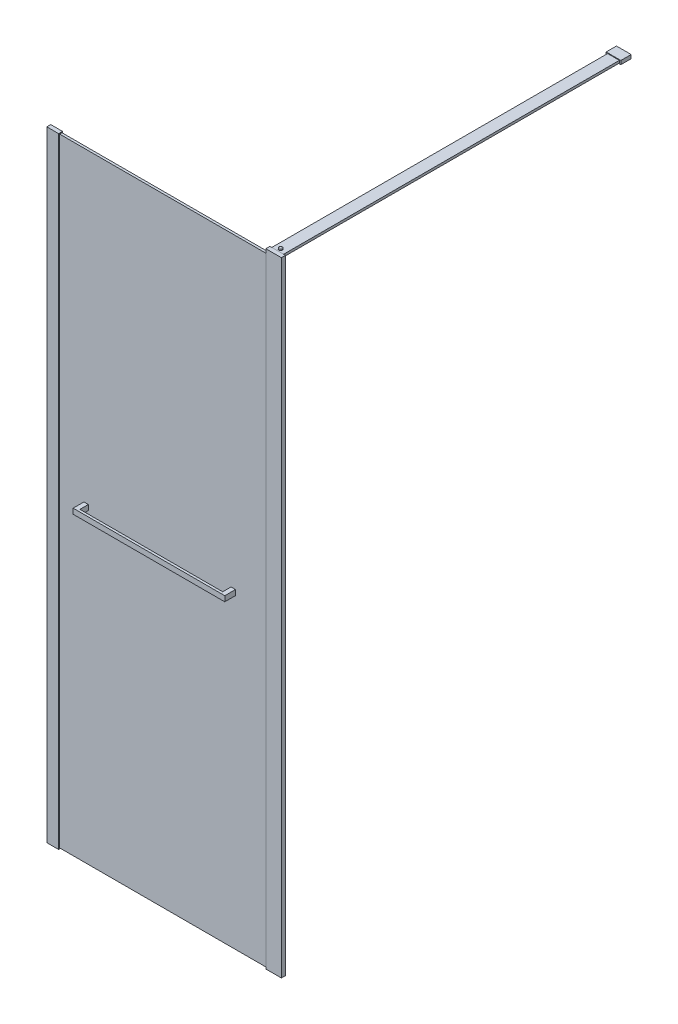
ISO-10303-21;
HEADER;
FILE_DESCRIPTION(('STEP AP214'),'2;1');
FILE_NAME('part.step','',(''),(''),'','','');
FILE_SCHEMA(('AUTOMOTIVE_DESIGN { 1 0 10303 214 1 1 1 1 }'));
ENDSEC;
DATA;
#1=APPLICATION_CONTEXT('core data for automotive mechanical design processes');
#2=APPLICATION_PROTOCOL_DEFINITION('international standard','automotive_design',2000,#1);
#3=PRODUCT_CONTEXT('',#1,'mechanical');
#4=PRODUCT('Part','Part','',(#3));
#5=PRODUCT_RELATED_PRODUCT_CATEGORY('part','',(#4));
#6=PRODUCT_DEFINITION_FORMATION('','',#4);
#7=PRODUCT_DEFINITION_CONTEXT('part definition',#1,'design');
#8=PRODUCT_DEFINITION('design','',#6,#7);
#9=PRODUCT_DEFINITION_SHAPE('','',#8);
#10=(LENGTH_UNIT() NAMED_UNIT(*) SI_UNIT(.MILLI.,.METRE.));
#11=(NAMED_UNIT(*) PLANE_ANGLE_UNIT() SI_UNIT($,.RADIAN.));
#12=(NAMED_UNIT(*) SI_UNIT($,.STERADIAN.) SOLID_ANGLE_UNIT());
#13=UNCERTAINTY_MEASURE_WITH_UNIT(LENGTH_MEASURE(1.E-05),#10,'distance_accuracy_value','');
#14=(GEOMETRIC_REPRESENTATION_CONTEXT(3) GLOBAL_UNCERTAINTY_ASSIGNED_CONTEXT((#13)) GLOBAL_UNIT_ASSIGNED_CONTEXT((#10,
#11,#12)) REPRESENTATION_CONTEXT('',''));
#15=CARTESIAN_POINT('',(0.,0.,0.));
#16=DIRECTION('',(0.,0.,1.));
#17=DIRECTION('',(1.,0.,0.));
#18=AXIS2_PLACEMENT_3D('',#15,#16,#17);
#19=CARTESIAN_POINT('',(137.5,1062.,-21.4));
#20=DIRECTION('',(1.,0.,0.));
#21=DIRECTION('',(0.,0.,-1.));
#22=AXIS2_PLACEMENT_3D('',#19,#20,#21);
#23=PLANE('',#22);
#24=DIRECTION('',(0.,1.,0.));
#25=VECTOR('',#24,1.);
#26=CARTESIAN_POINT('',(137.5,1062.,25.1));
#27=LINE('',#26,#25);
#28=CARTESIAN_POINT('',(137.5,1044.,25.1));
#29=VERTEX_POINT('',#28);
#30=CARTESIAN_POINT('',(137.5,1062.,25.1));
#31=VERTEX_POINT('',#30);
#32=EDGE_CURVE('E65',#29,#31,#27,.T.);
#33=ORIENTED_EDGE('',*,*,#32,.F.);
#34=DIRECTION('',(0.,0.,1.));
#35=VECTOR('',#34,1.);
#36=CARTESIAN_POINT('',(137.5,1044.,-21.4));
#37=LINE('',#36,#35);
#38=CARTESIAN_POINT('',(137.5,1044.,-21.4));
#39=VERTEX_POINT('',#38);
#40=EDGE_CURVE('E12',#39,#29,#37,.T.);
#41=ORIENTED_EDGE('',*,*,#40,.F.);
#42=DIRECTION('',(0.,1.,0.));
#43=VECTOR('',#42,1.);
#44=CARTESIAN_POINT('',(137.5,1062.,-21.4));
#45=LINE('',#44,#43);
#46=CARTESIAN_POINT('',(137.5,1062.,-21.4));
#47=VERTEX_POINT('',#46);
#48=EDGE_CURVE('E195',#39,#47,#45,.T.);
#49=ORIENTED_EDGE('',*,*,#48,.T.);
#50=DIRECTION('',(0.,0.,1.));
#51=VECTOR('',#50,1.);
#52=CARTESIAN_POINT('',(137.5,1062.,-21.4));
#53=LINE('',#52,#51);
#54=EDGE_CURVE('E178',#47,#31,#53,.T.);
#55=ORIENTED_EDGE('',*,*,#54,.T.);
#56=EDGE_LOOP('',(#33,#41,#49,#55));
#57=FACE_BOUND('',#56,.T.);
#58=ADVANCED_FACE('F48',(#57),#23,.T.);
#59=CARTESIAN_POINT('',(122.5,1044.,-21.4));
#60=DIRECTION('',(0.,-1.,0.));
#61=DIRECTION('',(0.,0.,-1.));
#62=AXIS2_PLACEMENT_3D('',#59,#60,#61);
#63=PLANE('',#62);
#64=ORIENTED_EDGE('',*,*,#40,.T.);
#65=DIRECTION('',(-1.,0.,0.));
#66=VECTOR('',#65,1.);
#67=CARTESIAN_POINT('',(642.197715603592,1044.,25.1));
#68=LINE('',#67,#66);
#69=CARTESIAN_POINT('',(622.5,1044.,25.1));
#70=VERTEX_POINT('',#69);
#71=EDGE_CURVE('E168',#70,#29,#68,.T.);
#72=ORIENTED_EDGE('',*,*,#71,.F.);
#73=DIRECTION('',(0.,0.,1.));
#74=VECTOR('',#73,1.);
#75=CARTESIAN_POINT('',(622.5,1044.,-21.4));
#76=LINE('',#75,#74);
#77=CARTESIAN_POINT('',(622.5,1044.,-21.4));
#78=VERTEX_POINT('',#77);
#79=EDGE_CURVE('E151',#78,#70,#76,.T.);
#80=ORIENTED_EDGE('',*,*,#79,.F.);
#81=DIRECTION('',(1.,0.,0.));
#82=VECTOR('',#81,1.);
#83=CARTESIAN_POINT('',(622.5,1044.,-21.4));
#84=LINE('',#83,#82);
#85=CARTESIAN_POINT('',(637.5,1044.,-21.4));
#86=VERTEX_POINT('',#85);
#87=EDGE_CURVE('E133',#78,#86,#84,.T.);
#88=ORIENTED_EDGE('',*,*,#87,.T.);
#89=DIRECTION('',(0.,0.,1.));
#90=VECTOR('',#89,1.);
#91=CARTESIAN_POINT('',(637.5,1044.,-21.4));
#92=LINE('',#91,#90);
#93=CARTESIAN_POINT('',(637.5,1044.,33.1));
#94=VERTEX_POINT('',#93);
#95=EDGE_CURVE('E149',#86,#94,#92,.T.);
#96=ORIENTED_EDGE('',*,*,#95,.T.);
#97=DIRECTION('',(1.,0.,0.));
#98=VECTOR('',#97,1.);
#99=CARTESIAN_POINT('',(122.5,1044.,33.1));
#100=LINE('',#99,#98);
#101=CARTESIAN_POINT('',(122.5,1044.,33.1));
#102=VERTEX_POINT('',#101);
#103=EDGE_CURVE('E137',#102,#94,#100,.T.);
#104=ORIENTED_EDGE('',*,*,#103,.F.);
#105=DIRECTION('',(0.,0.,1.));
#106=VECTOR('',#105,1.);
#107=CARTESIAN_POINT('',(122.5,1044.,-21.4));
#108=LINE('',#107,#106);
#109=CARTESIAN_POINT('',(122.5,1044.,-21.4));
#110=VERTEX_POINT('',#109);
#111=EDGE_CURVE('E57',#110,#102,#108,.T.);
#112=ORIENTED_EDGE('',*,*,#111,.F.);
#113=DIRECTION('',(1.,0.,0.));
#114=VECTOR('',#113,1.);
#115=CARTESIAN_POINT('',(122.5,1044.,-21.4));
#116=LINE('',#115,#114);
#117=EDGE_CURVE('E183',#110,#39,#116,.T.);
#118=ORIENTED_EDGE('',*,*,#117,.T.);
#119=EDGE_LOOP('',(#64,#72,#80,#88,#96,#104,#112,#118));
#120=FACE_BOUND('',#119,.T.);
#121=ADVANCED_FACE('F199',(#120),#63,.T.);
#122=CARTESIAN_POINT('',(122.5,1062.,-21.4));
#123=DIRECTION('',(-1.,0.,0.));
#124=DIRECTION('',(0.,0.,1.));
#125=AXIS2_PLACEMENT_3D('',#122,#123,#124);
#126=PLANE('',#125);
#127=ORIENTED_EDGE('',*,*,#111,.T.);
#128=DIRECTION('',(0.,-1.,0.));
#129=VECTOR('',#128,1.);
#130=CARTESIAN_POINT('',(122.5,1062.,33.1));
#131=LINE('',#130,#129);
#132=CARTESIAN_POINT('',(122.5,1062.,33.1));
#133=VERTEX_POINT('',#132);
#134=EDGE_CURVE('E123',#133,#102,#131,.T.);
#135=ORIENTED_EDGE('',*,*,#134,.F.);
#136=DIRECTION('',(0.,0.,1.));
#137=VECTOR('',#136,1.);
#138=CARTESIAN_POINT('',(122.5,1062.,-21.4));
#139=LINE('',#138,#137);
#140=CARTESIAN_POINT('',(122.5,1062.,-21.4));
#141=VERTEX_POINT('',#140);
#142=EDGE_CURVE('E118',#141,#133,#139,.T.);
#143=ORIENTED_EDGE('',*,*,#142,.F.);
#144=DIRECTION('',(0.,-1.,0.));
#145=VECTOR('',#144,1.);
#146=CARTESIAN_POINT('',(122.5,1062.,-21.4));
#147=LINE('',#146,#145);
#148=EDGE_CURVE('E188',#141,#110,#147,.T.);
#149=ORIENTED_EDGE('',*,*,#148,.T.);
#150=EDGE_LOOP('',(#127,#135,#143,#149));
#151=FACE_BOUND('',#150,.T.);
#152=ADVANCED_FACE('F220',(#151),#126,.T.);
#153=CARTESIAN_POINT('',(122.5,1062.,-21.4));
#154=DIRECTION('',(0.,1.,0.));
#155=DIRECTION('',(0.,0.,1.));
#156=AXIS2_PLACEMENT_3D('',#153,#154,#155);
#157=PLANE('',#156);
#158=ORIENTED_EDGE('',*,*,#142,.T.);
#159=DIRECTION('',(-1.,0.,0.));
#160=VECTOR('',#159,1.);
#161=CARTESIAN_POINT('',(122.5,1062.,33.1));
#162=LINE('',#161,#160);
#163=CARTESIAN_POINT('',(637.5,1062.,33.1));
#164=VERTEX_POINT('',#163);
#165=EDGE_CURVE('E111',#164,#133,#162,.T.);
#166=ORIENTED_EDGE('',*,*,#165,.F.);
#167=DIRECTION('',(0.,0.,1.));
#168=VECTOR('',#167,1.);
#169=CARTESIAN_POINT('',(637.5,1062.,-21.4));
#170=LINE('',#169,#168);
#171=CARTESIAN_POINT('',(637.5,1062.,-21.4));
#172=VERTEX_POINT('',#171);
#173=EDGE_CURVE('E115',#172,#164,#170,.T.);
#174=ORIENTED_EDGE('',*,*,#173,.F.);
#175=DIRECTION('',(-1.,0.,0.));
#176=VECTOR('',#175,1.);
#177=CARTESIAN_POINT('',(622.5,1062.,-21.4));
#178=LINE('',#177,#176);
#179=CARTESIAN_POINT('',(622.5,1062.,-21.4));
#180=VERTEX_POINT('',#179);
#181=EDGE_CURVE('E140',#172,#180,#178,.T.);
#182=ORIENTED_EDGE('',*,*,#181,.T.);
#183=DIRECTION('',(0.,0.,1.));
#184=VECTOR('',#183,1.);
#185=CARTESIAN_POINT('',(622.5,1062.,-21.4));
#186=LINE('',#185,#184);
#187=CARTESIAN_POINT('',(622.5,1062.,25.1));
#188=VERTEX_POINT('',#187);
#189=EDGE_CURVE('E132',#180,#188,#186,.T.);
#190=ORIENTED_EDGE('',*,*,#189,.T.);
#191=DIRECTION('',(-1.,0.,0.));
#192=VECTOR('',#191,1.);
#193=CARTESIAN_POINT('',(642.197715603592,1062.,25.1));
#194=LINE('',#193,#192);
#195=EDGE_CURVE('E165',#188,#31,#194,.T.);
#196=ORIENTED_EDGE('',*,*,#195,.T.);
#197=ORIENTED_EDGE('',*,*,#54,.F.);
#198=DIRECTION('',(-1.,0.,0.));
#199=VECTOR('',#198,1.);
#200=CARTESIAN_POINT('',(122.5,1062.,-21.4));
#201=LINE('',#200,#199);
#202=EDGE_CURVE('E192',#47,#141,#201,.T.);
#203=ORIENTED_EDGE('',*,*,#202,.T.);
#204=EDGE_LOOP('',(#158,#166,#174,#182,#190,#196,#197,#203));
#205=FACE_BOUND('',#204,.T.);
#206=ADVANCED_FACE('F113',(#205),#157,.T.);
#207=CARTESIAN_POINT('',(137.5,1044.,-21.4));
#208=DIRECTION('',(0.,0.,1.));
#209=DIRECTION('',(1.,0.,0.));
#210=AXIS2_PLACEMENT_3D('',#207,#208,#209);
#211=PLANE('',#210);
#212=ORIENTED_EDGE('',*,*,#48,.F.);
#213=ORIENTED_EDGE('',*,*,#117,.F.);
#214=ORIENTED_EDGE('',*,*,#148,.F.);
#215=ORIENTED_EDGE('',*,*,#202,.F.);
#216=EDGE_LOOP('',(#212,#213,#214,#215));
#217=FACE_BOUND('',#216,.T.);
#218=ADVANCED_FACE('F227',(#217),#211,.F.);
#219=CARTESIAN_POINT('',(137.5,1044.,33.1));
#220=DIRECTION('',(0.,0.,1.));
#221=DIRECTION('',(1.,0.,0.));
#222=AXIS2_PLACEMENT_3D('',#219,#220,#221);
#223=PLANE('',#222);
#224=ORIENTED_EDGE('',*,*,#103,.T.);
#225=DIRECTION('',(0.,1.,0.));
#226=VECTOR('',#225,1.);
#227=CARTESIAN_POINT('',(637.5,1062.,33.1));
#228=LINE('',#227,#226);
#229=EDGE_CURVE('E129',#94,#164,#228,.T.);
#230=ORIENTED_EDGE('',*,*,#229,.T.);
#231=ORIENTED_EDGE('',*,*,#165,.T.);
#232=ORIENTED_EDGE('',*,*,#134,.T.);
#233=EDGE_LOOP('',(#224,#230,#231,#232));
#234=FACE_BOUND('',#233,.T.);
#235=ADVANCED_FACE('F135',(#234),#223,.T.);
#236=CARTESIAN_POINT('',(642.197715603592,1062.,25.1));
#237=DIRECTION('',(0.,0.,1.));
#238=DIRECTION('',(1.,0.,0.));
#239=AXIS2_PLACEMENT_3D('',#236,#237,#238);
#240=PLANE('',#239);
#241=ORIENTED_EDGE('',*,*,#195,.F.);
#242=DIRECTION('',(0.,-1.,0.));
#243=VECTOR('',#242,1.);
#244=CARTESIAN_POINT('',(622.5,1062.,25.1));
#245=LINE('',#244,#243);
#246=EDGE_CURVE('E51',#188,#70,#245,.T.);
#247=ORIENTED_EDGE('',*,*,#246,.T.);
#248=ORIENTED_EDGE('',*,*,#71,.T.);
#249=ORIENTED_EDGE('',*,*,#32,.T.);
#250=EDGE_LOOP('',(#241,#247,#248,#249));
#251=FACE_BOUND('',#250,.T.);
#252=ADVANCED_FACE('F205',(#251),#240,.F.);
#253=CARTESIAN_POINT('',(622.5,1062.,-21.4));
#254=DIRECTION('',(-1.,0.,0.));
#255=DIRECTION('',(0.,0.,1.));
#256=AXIS2_PLACEMENT_3D('',#253,#254,#255);
#257=PLANE('',#256);
#258=ORIENTED_EDGE('',*,*,#246,.F.);
#259=ORIENTED_EDGE('',*,*,#189,.F.);
#260=DIRECTION('',(0.,-1.,0.));
#261=VECTOR('',#260,1.);
#262=CARTESIAN_POINT('',(622.5,1062.,-21.4));
#263=LINE('',#262,#261);
#264=EDGE_CURVE('E144',#180,#78,#263,.T.);
#265=ORIENTED_EDGE('',*,*,#264,.T.);
#266=ORIENTED_EDGE('',*,*,#79,.T.);
#267=EDGE_LOOP('',(#258,#259,#265,#266));
#268=FACE_BOUND('',#267,.T.);
#269=ADVANCED_FACE('F206',(#268),#257,.T.);
#270=CARTESIAN_POINT('',(637.5,1062.,-21.4));
#271=DIRECTION('',(1.,0.,0.));
#272=DIRECTION('',(0.,0.,-1.));
#273=AXIS2_PLACEMENT_3D('',#270,#271,#272);
#274=PLANE('',#273);
#275=ORIENTED_EDGE('',*,*,#173,.T.);
#276=ORIENTED_EDGE('',*,*,#229,.F.);
#277=ORIENTED_EDGE('',*,*,#95,.F.);
#278=DIRECTION('',(0.,1.,0.));
#279=VECTOR('',#278,1.);
#280=CARTESIAN_POINT('',(637.5,1062.,-21.4));
#281=LINE('',#280,#279);
#282=EDGE_CURVE('E131',#86,#172,#281,.T.);
#283=ORIENTED_EDGE('',*,*,#282,.T.);
#284=EDGE_LOOP('',(#275,#276,#277,#283));
#285=FACE_BOUND('',#284,.T.);
#286=ADVANCED_FACE('F128',(#285),#274,.T.);
#287=CARTESIAN_POINT('',(637.5,1044.,-21.4));
#288=DIRECTION('',(0.,0.,1.));
#289=DIRECTION('',(1.,0.,0.));
#290=AXIS2_PLACEMENT_3D('',#287,#288,#289);
#291=PLANE('',#290);
#292=ORIENTED_EDGE('',*,*,#282,.F.);
#293=ORIENTED_EDGE('',*,*,#87,.F.);
#294=ORIENTED_EDGE('',*,*,#264,.F.);
#295=ORIENTED_EDGE('',*,*,#181,.F.);
#296=EDGE_LOOP('',(#292,#293,#294,#295));
#297=FACE_BOUND('',#296,.T.);
#298=ADVANCED_FACE('F202',(#297),#291,.F.);
#299=CLOSED_SHELL('',(#58,#121,#152,#206,#218,#235,#252,#269,#286,#298));
#300=MANIFOLD_SOLID_BREP('B2',#299);
#301=CARTESIAN_POINT('',(789.9,2119.,-1184.4));
#302=DIRECTION('',(-1.,0.,0.));
#303=DIRECTION('',(0.,0.,1.));
#304=AXIS2_PLACEMENT_3D('',#301,#302,#303);
#305=PLANE('',#304);
#306=DIRECTION('',(0.,-1.,0.));
#307=VECTOR('',#306,1.);
#308=CARTESIAN_POINT('',(789.9,2119.,-1155.));
#309=LINE('',#308,#307);
#310=CARTESIAN_POINT('',(789.9,2119.,-1155.));
#311=VERTEX_POINT('',#310);
#312=CARTESIAN_POINT('',(789.9,2111.,-1155.));
#313=VERTEX_POINT('',#312);
#314=EDGE_CURVE('E418',#311,#313,#309,.T.);
#315=ORIENTED_EDGE('',*,*,#314,.F.);
#316=DIRECTION('',(0.,0.,1.));
#317=VECTOR('',#316,1.);
#318=CARTESIAN_POINT('',(789.9,2119.,-1184.4));
#319=LINE('',#318,#317);
#320=CARTESIAN_POINT('',(789.9,2119.,-14.4));
#321=VERTEX_POINT('',#320);
#322=EDGE_CURVE('E433',#311,#321,#319,.T.);
#323=ORIENTED_EDGE('',*,*,#322,.T.);
#324=DIRECTION('',(0.,-1.,0.));
#325=VECTOR('',#324,1.);
#326=CARTESIAN_POINT('',(789.9,2119.,-14.4));
#327=LINE('',#326,#325);
#328=CARTESIAN_POINT('',(789.9,2111.,-14.4));
#329=VERTEX_POINT('',#328);
#330=EDGE_CURVE('E421',#321,#329,#327,.T.);
#331=ORIENTED_EDGE('',*,*,#330,.T.);
#332=DIRECTION('',(0.,0.,1.));
#333=VECTOR('',#332,1.);
#334=CARTESIAN_POINT('',(789.9,2111.,-1184.4));
#335=LINE('',#334,#333);
#336=EDGE_CURVE('E328',#313,#329,#335,.T.);
#337=ORIENTED_EDGE('',*,*,#336,.F.);
#338=EDGE_LOOP('',(#315,#323,#331,#337));
#339=FACE_BOUND('',#338,.T.);
#340=ADVANCED_FACE('F320',(#339),#305,.F.);
#341=CARTESIAN_POINT('',(789.9,2111.,-1184.4));
#342=DIRECTION('',(0.,1.,0.));
#343=DIRECTION('',(0.,0.,1.));
#344=AXIS2_PLACEMENT_3D('',#341,#342,#343);
#345=PLANE('',#344);
#346=DIRECTION('',(-1.,0.,0.));
#347=VECTOR('',#346,1.);
#348=CARTESIAN_POINT('',(789.9,2111.,-1155.));
#349=LINE('',#348,#347);
#350=CARTESIAN_POINT('',(749.9,2111.,-1155.));
#351=VERTEX_POINT('',#350);
#352=EDGE_CURVE('E335',#313,#351,#349,.T.);
#353=ORIENTED_EDGE('',*,*,#352,.F.);
#354=ORIENTED_EDGE('',*,*,#336,.T.);
#355=DIRECTION('',(-1.,0.,0.));
#356=VECTOR('',#355,1.);
#357=CARTESIAN_POINT('',(789.9,2111.,-14.4));
#358=LINE('',#357,#356);
#359=CARTESIAN_POINT('',(749.9,2111.,-14.4));
#360=VERTEX_POINT('',#359);
#361=EDGE_CURVE('E424',#329,#360,#358,.T.);
#362=ORIENTED_EDGE('',*,*,#361,.T.);
#363=DIRECTION('',(0.,0.,1.));
#364=VECTOR('',#363,1.);
#365=CARTESIAN_POINT('',(749.9,2111.,-1184.4));
#366=LINE('',#365,#364);
#367=EDGE_CURVE('E437',#351,#360,#366,.T.);
#368=ORIENTED_EDGE('',*,*,#367,.F.);
#369=EDGE_LOOP('',(#353,#354,#362,#368));
#370=FACE_BOUND('',#369,.T.);
#371=ADVANCED_FACE('F439',(#370),#345,.F.);
#372=CARTESIAN_POINT('',(749.9,2119.,-1184.4));
#373=DIRECTION('',(1.,0.,0.));
#374=DIRECTION('',(0.,0.,-1.));
#375=AXIS2_PLACEMENT_3D('',#372,#373,#374);
#376=PLANE('',#375);
#377=DIRECTION('',(0.,1.,0.));
#378=VECTOR('',#377,1.);
#379=CARTESIAN_POINT('',(749.9,2119.,-1155.));
#380=LINE('',#379,#378);
#381=CARTESIAN_POINT('',(749.9,2119.,-1155.));
#382=VERTEX_POINT('',#381);
#383=EDGE_CURVE('E343',#351,#382,#380,.T.);
#384=ORIENTED_EDGE('',*,*,#383,.F.);
#385=ORIENTED_EDGE('',*,*,#367,.T.);
#386=DIRECTION('',(0.,1.,0.));
#387=VECTOR('',#386,1.);
#388=CARTESIAN_POINT('',(749.9,2119.,-14.4));
#389=LINE('',#388,#387);
#390=CARTESIAN_POINT('',(749.9,2119.,-14.4));
#391=VERTEX_POINT('',#390);
#392=EDGE_CURVE('E427',#360,#391,#389,.T.);
#393=ORIENTED_EDGE('',*,*,#392,.T.);
#394=DIRECTION('',(0.,0.,1.));
#395=VECTOR('',#394,1.);
#396=CARTESIAN_POINT('',(749.9,2119.,-1184.4));
#397=LINE('',#396,#395);
#398=EDGE_CURVE('E435',#382,#391,#397,.T.);
#399=ORIENTED_EDGE('',*,*,#398,.F.);
#400=EDGE_LOOP('',(#384,#385,#393,#399));
#401=FACE_BOUND('',#400,.T.);
#402=ADVANCED_FACE('F449',(#401),#376,.F.);
#403=CARTESIAN_POINT('',(789.9,2119.,-1184.4));
#404=DIRECTION('',(0.,-1.,0.));
#405=DIRECTION('',(0.,0.,-1.));
#406=AXIS2_PLACEMENT_3D('',#403,#404,#405);
#407=PLANE('',#406);
#408=CARTESIAN_POINT('',(769.9,2119.,-24.3999999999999));
#409=DIRECTION('',(0.,-1.,0.));
#410=DIRECTION('',(0.,0.,-1.));
#411=AXIS2_PLACEMENT_3D('',#408,#409,#410);
#412=CIRCLE('',#411,5.90000000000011);
#413=CARTESIAN_POINT('',(769.9,2119.,-30.3));
#414=VERTEX_POINT('',#413);
#415=EDGE_CURVE('E512',#414,#414,#412,.T.);
#416=ORIENTED_EDGE('',*,*,#415,.T.);
#417=EDGE_LOOP('',(#416));
#418=FACE_BOUND('',#417,.T.);
#419=DIRECTION('',(1.,0.,0.));
#420=VECTOR('',#419,1.);
#421=CARTESIAN_POINT('',(789.9,2119.,-1155.));
#422=LINE('',#421,#420);
#423=EDGE_CURVE('E46',#382,#311,#422,.T.);
#424=ORIENTED_EDGE('',*,*,#423,.F.);
#425=ORIENTED_EDGE('',*,*,#398,.T.);
#426=DIRECTION('',(1.,0.,0.));
#427=VECTOR('',#426,1.);
#428=CARTESIAN_POINT('',(789.9,2119.,-14.4));
#429=LINE('',#428,#427);
#430=EDGE_CURVE('E430',#391,#321,#429,.T.);
#431=ORIENTED_EDGE('',*,*,#430,.T.);
#432=ORIENTED_EDGE('',*,*,#322,.F.);
#433=EDGE_LOOP('',(#424,#425,#431,#432));
#434=FACE_BOUND('',#433,.T.);
#435=ADVANCED_FACE('F448',(#418,#434),#407,.F.);
#436=CARTESIAN_POINT('',(789.9,2111.,-14.4));
#437=DIRECTION('',(0.,0.,-1.));
#438=DIRECTION('',(-1.,0.,0.));
#439=AXIS2_PLACEMENT_3D('',#436,#437,#438);
#440=PLANE('',#439);
#441=ORIENTED_EDGE('',*,*,#330,.F.);
#442=ORIENTED_EDGE('',*,*,#430,.F.);
#443=ORIENTED_EDGE('',*,*,#392,.F.);
#444=ORIENTED_EDGE('',*,*,#361,.F.);
#445=EDGE_LOOP('',(#441,#442,#443,#444));
#446=FACE_BOUND('',#445,.T.);
#447=ADVANCED_FACE('F445',(#446),#440,.F.);
#448=CARTESIAN_POINT('',(744.9,2108.75,-1155.));
#449=DIRECTION('',(0.,0.,-1.));
#450=DIRECTION('',(-1.,0.,0.));
#451=AXIS2_PLACEMENT_3D('',#448,#449,#450);
#452=PLANE('',#451);
#453=DIRECTION('',(0.,1.,0.));
#454=VECTOR('',#453,1.);
#455=CARTESIAN_POINT('',(744.9,2121.25,-1155.));
#456=LINE('',#455,#454);
#457=CARTESIAN_POINT('',(744.9,2108.75,-1155.));
#458=VERTEX_POINT('',#457);
#459=CARTESIAN_POINT('',(744.9,2121.25,-1155.));
#460=VERTEX_POINT('',#459);
#461=EDGE_CURVE('E410',#458,#460,#456,.T.);
#462=ORIENTED_EDGE('',*,*,#461,.F.);
#463=DIRECTION('',(-1.,0.,0.));
#464=VECTOR('',#463,1.);
#465=CARTESIAN_POINT('',(794.9,2108.75,-1155.));
#466=LINE('',#465,#464);
#467=CARTESIAN_POINT('',(794.9,2108.75,-1155.));
#468=VERTEX_POINT('',#467);
#469=EDGE_CURVE('E406',#468,#458,#466,.T.);
#470=ORIENTED_EDGE('',*,*,#469,.F.);
#471=DIRECTION('',(0.,-1.,0.));
#472=VECTOR('',#471,1.);
#473=CARTESIAN_POINT('',(794.9,2121.25,-1155.));
#474=LINE('',#473,#472);
#475=CARTESIAN_POINT('',(794.9,2121.25,-1155.));
#476=VERTEX_POINT('',#475);
#477=EDGE_CURVE('E493',#476,#468,#474,.T.);
#478=ORIENTED_EDGE('',*,*,#477,.F.);
#479=DIRECTION('',(1.,0.,0.));
#480=VECTOR('',#479,1.);
#481=CARTESIAN_POINT('',(794.9,2121.25,-1155.));
#482=LINE('',#481,#480);
#483=EDGE_CURVE('E496',#460,#476,#482,.T.);
#484=ORIENTED_EDGE('',*,*,#483,.F.);
#485=EDGE_LOOP('',(#462,#470,#478,#484));
#486=FACE_BOUND('',#485,.T.);
#487=ORIENTED_EDGE('',*,*,#423,.T.);
#488=ORIENTED_EDGE('',*,*,#314,.T.);
#489=ORIENTED_EDGE('',*,*,#352,.T.);
#490=ORIENTED_EDGE('',*,*,#383,.T.);
#491=EDGE_LOOP('',(#487,#488,#489,#490));
#492=FACE_BOUND('',#491,.T.);
#493=ADVANCED_FACE('F451',(#486,#492),#452,.F.);
#494=CARTESIAN_POINT('',(744.9,2121.25,-1190.));
#495=DIRECTION('',(1.,0.,0.));
#496=DIRECTION('',(0.,0.,-1.));
#497=AXIS2_PLACEMENT_3D('',#494,#495,#496);
#498=PLANE('',#497);
#499=ORIENTED_EDGE('',*,*,#461,.T.);
#500=DIRECTION('',(0.,0.,1.));
#501=VECTOR('',#500,1.);
#502=CARTESIAN_POINT('',(744.9,2121.25,-1190.));
#503=LINE('',#502,#501);
#504=CARTESIAN_POINT('',(744.9,2121.25,-1190.));
#505=VERTEX_POINT('',#504);
#506=EDGE_CURVE('E390',#505,#460,#503,.T.);
#507=ORIENTED_EDGE('',*,*,#506,.F.);
#508=DIRECTION('',(0.,1.,0.));
#509=VECTOR('',#508,1.);
#510=CARTESIAN_POINT('',(744.9,2121.25,-1190.));
#511=LINE('',#510,#509);
#512=CARTESIAN_POINT('',(744.9,2108.75,-1190.));
#513=VERTEX_POINT('',#512);
#514=EDGE_CURVE('E397',#513,#505,#511,.T.);
#515=ORIENTED_EDGE('',*,*,#514,.F.);
#516=DIRECTION('',(0.,0.,1.));
#517=VECTOR('',#516,1.);
#518=CARTESIAN_POINT('',(744.9,2108.75,-1190.));
#519=LINE('',#518,#517);
#520=EDGE_CURVE('E490',#513,#458,#519,.T.);
#521=ORIENTED_EDGE('',*,*,#520,.T.);
#522=EDGE_LOOP('',(#499,#507,#515,#521));
#523=FACE_BOUND('',#522,.T.);
#524=ADVANCED_FACE('F408',(#523),#498,.F.);
#525=CARTESIAN_POINT('',(794.9,2121.25,-1190.));
#526=DIRECTION('',(0.,-1.,0.));
#527=DIRECTION('',(0.,0.,-1.));
#528=AXIS2_PLACEMENT_3D('',#525,#526,#527);
#529=PLANE('',#528);
#530=ORIENTED_EDGE('',*,*,#483,.T.);
#531=DIRECTION('',(0.,0.,1.));
#532=VECTOR('',#531,1.);
#533=CARTESIAN_POINT('',(794.9,2121.25,-1190.));
#534=LINE('',#533,#532);
#535=CARTESIAN_POINT('',(794.9,2121.25,-1190.));
#536=VERTEX_POINT('',#535);
#537=EDGE_CURVE('E393',#536,#476,#534,.T.);
#538=ORIENTED_EDGE('',*,*,#537,.F.);
#539=DIRECTION('',(1.,0.,0.));
#540=VECTOR('',#539,1.);
#541=CARTESIAN_POINT('',(794.9,2121.25,-1190.));
#542=LINE('',#541,#540);
#543=EDGE_CURVE('E386',#505,#536,#542,.T.);
#544=ORIENTED_EDGE('',*,*,#543,.F.);
#545=ORIENTED_EDGE('',*,*,#506,.T.);
#546=EDGE_LOOP('',(#530,#538,#544,#545));
#547=FACE_BOUND('',#546,.T.);
#548=ADVANCED_FACE('F388',(#547),#529,.F.);
#549=CARTESIAN_POINT('',(794.9,2121.25,-1190.));
#550=DIRECTION('',(-1.,0.,0.));
#551=DIRECTION('',(0.,0.,1.));
#552=AXIS2_PLACEMENT_3D('',#549,#550,#551);
#553=PLANE('',#552);
#554=ORIENTED_EDGE('',*,*,#477,.T.);
#555=DIRECTION('',(0.,0.,1.));
#556=VECTOR('',#555,1.);
#557=CARTESIAN_POINT('',(794.9,2108.75,-1190.));
#558=LINE('',#557,#556);
#559=CARTESIAN_POINT('',(794.9,2108.75,-1190.));
#560=VERTEX_POINT('',#559);
#561=EDGE_CURVE('E413',#560,#468,#558,.T.);
#562=ORIENTED_EDGE('',*,*,#561,.F.);
#563=DIRECTION('',(0.,-1.,0.));
#564=VECTOR('',#563,1.);
#565=CARTESIAN_POINT('',(794.9,2121.25,-1190.));
#566=LINE('',#565,#564);
#567=EDGE_CURVE('E396',#536,#560,#566,.T.);
#568=ORIENTED_EDGE('',*,*,#567,.F.);
#569=ORIENTED_EDGE('',*,*,#537,.T.);
#570=EDGE_LOOP('',(#554,#562,#568,#569));
#571=FACE_BOUND('',#570,.T.);
#572=ADVANCED_FACE('F478',(#571),#553,.F.);
#573=CARTESIAN_POINT('',(794.9,2108.75,-1190.));
#574=DIRECTION('',(0.,1.,0.));
#575=DIRECTION('',(0.,0.,1.));
#576=AXIS2_PLACEMENT_3D('',#573,#574,#575);
#577=PLANE('',#576);
#578=ORIENTED_EDGE('',*,*,#469,.T.);
#579=ORIENTED_EDGE('',*,*,#520,.F.);
#580=DIRECTION('',(-1.,0.,0.));
#581=VECTOR('',#580,1.);
#582=CARTESIAN_POINT('',(794.9,2108.75,-1190.));
#583=LINE('',#582,#581);
#584=EDGE_CURVE('E402',#560,#513,#583,.T.);
#585=ORIENTED_EDGE('',*,*,#584,.F.);
#586=ORIENTED_EDGE('',*,*,#561,.T.);
#587=EDGE_LOOP('',(#578,#579,#585,#586));
#588=FACE_BOUND('',#587,.T.);
#589=ADVANCED_FACE('F480',(#588),#577,.F.);
#590=CARTESIAN_POINT('',(744.9,2108.75,-1190.));
#591=DIRECTION('',(0.,0.,-1.));
#592=DIRECTION('',(-1.,0.,0.));
#593=AXIS2_PLACEMENT_3D('',#590,#591,#592);
#594=PLANE('',#593);
#595=ORIENTED_EDGE('',*,*,#514,.T.);
#596=ORIENTED_EDGE('',*,*,#543,.T.);
#597=ORIENTED_EDGE('',*,*,#567,.T.);
#598=ORIENTED_EDGE('',*,*,#584,.T.);
#599=EDGE_LOOP('',(#595,#596,#597,#598));
#600=FACE_BOUND('',#599,.T.);
#601=ADVANCED_FACE('F400',(#600),#594,.T.);
#602=CARTESIAN_POINT('',(769.9,2115.34934210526,-24.4));
#603=DIRECTION('',(0.,-1.,0.));
#604=DIRECTION('',(0.,0.,-1.));
#605=AXIS2_PLACEMENT_3D('',#602,#603,#604);
#606=SPHERICAL_SURFACE('',#605,9.35065789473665);
#607=CARTESIAN_POINT('',(769.9,2122.8,-24.3999999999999));
#608=DIRECTION('',(0.,-1.,0.));
#609=DIRECTION('',(0.,0.,-1.));
#610=AXIS2_PLACEMENT_3D('',#607,#608,#609);
#611=CIRCLE('',#610,5.65000000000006);
#612=CARTESIAN_POINT('',(769.9,2122.8,-30.05));
#613=VERTEX_POINT('',#612);
#614=EDGE_CURVE('E509',#613,#613,#611,.T.);
#615=ORIENTED_EDGE('',*,*,#614,.F.);
#616=EDGE_LOOP('',(#615));
#617=FACE_BOUND('',#616,.T.);
#618=ADVANCED_FACE('F487',(#617),#606,.T.);
#619=CARTESIAN_POINT('',(769.9,2119.,-24.3999999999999));
#620=DIRECTION('',(0.,-1.,0.));
#621=DIRECTION('',(0.,0.,-1.));
#622=AXIS2_PLACEMENT_3D('',#619,#620,#621);
#623=CONICAL_SURFACE('',#622,5.90000000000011,0.0656948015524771);
#624=ORIENTED_EDGE('',*,*,#614,.T.);
#625=EDGE_LOOP('',(#624));
#626=FACE_BOUND('',#625,.T.);
#627=ORIENTED_EDGE('',*,*,#415,.F.);
#628=EDGE_LOOP('',(#627));
#629=FACE_BOUND('',#628,.T.);
#630=ADVANCED_FACE('F516',(#626,#629),#623,.T.);
#631=CLOSED_SHELL('',(#340,#371,#402,#435,#447,#493,#524,#548,#572,#589,#601,#618,#630));
#632=CARTESIAN_POINT('',(769.9,2122.53567623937,-24.3999999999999));
#633=DIRECTION('',(0.,-1.,0.));
#634=DIRECTION('',(0.,0.,-1.));
#635=AXIS2_PLACEMENT_3D('',#632,#633,#634);
#636=CONICAL_SURFACE('',#635,5.1663088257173,0.0656948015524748);
#637=CARTESIAN_POINT('',(769.9,2119.,-24.3999999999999));
#638=DIRECTION('',(0.,-1.,0.));
#639=DIRECTION('',(0.,0.,-1.));
#640=AXIS2_PLACEMENT_3D('',#637,#638,#639);
#641=CIRCLE('',#640,5.398919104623);
#642=CARTESIAN_POINT('',(769.9,2119.,-29.7989191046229));
#643=VERTEX_POINT('',#642);
#644=EDGE_CURVE('E497',#643,#643,#641,.T.);
#645=ORIENTED_EDGE('',*,*,#644,.T.);
#646=EDGE_LOOP('',(#645));
#647=FACE_BOUND('',#646,.T.);
#648=CARTESIAN_POINT('',(769.9,2122.53567623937,-24.3999999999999));
#649=DIRECTION('',(0.,-1.,0.));
#650=DIRECTION('',(0.,0.,-1.));
#651=AXIS2_PLACEMENT_3D('',#648,#649,#650);
#652=CIRCLE('',#651,5.1663088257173);
#653=CARTESIAN_POINT('',(769.9,2122.53567623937,-29.5663088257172));
#654=VERTEX_POINT('',#653);
#655=EDGE_CURVE('E501',#654,#654,#652,.T.);
#656=ORIENTED_EDGE('',*,*,#655,.F.);
#657=EDGE_LOOP('',(#656));
#658=FACE_BOUND('',#657,.T.);
#659=ADVANCED_FACE('F530',(#647,#658),#636,.F.);
#660=CARTESIAN_POINT('',(769.9,2115.34934210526,-24.4));
#661=DIRECTION('',(0.,-1.,0.));
#662=DIRECTION('',(0.,0.,1.));
#663=AXIS2_PLACEMENT_3D('',#660,#661,#662);
#664=SPHERICAL_SURFACE('',#663,8.85065789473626);
#665=ORIENTED_EDGE('',*,*,#655,.T.);
#666=EDGE_LOOP('',(#665));
#667=FACE_BOUND('',#666,.T.);
#668=ADVANCED_FACE('F527',(#667),#664,.F.);
#669=ORIENTED_EDGE('',*,*,#644,.F.);
#670=EDGE_LOOP('',(#669));
#671=FACE_BOUND('',#670,.T.);
#672=ADVANCED_FACE('F474',(#671),#407,.F.);
#673=CLOSED_SHELL('',(#659,#668,#672));
#674=ORIENTED_CLOSED_SHELL('',*,#673,.T.);
#675=BREP_WITH_VOIDS('B6',#631,(#674));
#676=CARTESIAN_POINT('',(796.4,2111.,-0.399999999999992));
#677=DIRECTION('',(0.,-1.,0.));
#678=DIRECTION('',(0.,0.,-1.));
#679=AXIS2_PLACEMENT_3D('',#676,#677,#678);
#680=PLANE('',#679);
#681=DIRECTION('',(-1.,0.,0.));
#682=VECTOR('',#681,1.);
#683=CARTESIAN_POINT('',(743.4,2111.,-11.4));
#684=LINE('',#683,#682);
#685=CARTESIAN_POINT('',(744.7,2111.,-11.4));
#686=VERTEX_POINT('',#685);
#687=CARTESIAN_POINT('',(743.4,2111.,-11.4));
#688=VERTEX_POINT('',#687);
#689=EDGE_CURVE('E781',#686,#688,#684,.T.);
#690=ORIENTED_EDGE('',*,*,#689,.F.);
#691=DIRECTION('',(0.,0.,1.));
#692=VECTOR('',#691,1.);
#693=CARTESIAN_POINT('',(744.7,2111.,-0.399999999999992));
#694=LINE('',#693,#692);
#695=CARTESIAN_POINT('',(744.7,2111.,-3.39999999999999));
#696=VERTEX_POINT('',#695);
#697=EDGE_CURVE('E647',#686,#696,#694,.T.);
#698=ORIENTED_EDGE('',*,*,#697,.T.);
#699=DIRECTION('',(1.,0.,0.));
#700=VECTOR('',#699,1.);
#701=CARTESIAN_POINT('',(753.5,2111.,-3.39999999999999));
#702=LINE('',#701,#700);
#703=CARTESIAN_POINT('',(743.4,2111.,-3.39999999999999));
#704=VERTEX_POINT('',#703);
#705=EDGE_CURVE('E785',#704,#696,#702,.T.);
#706=ORIENTED_EDGE('',*,*,#705,.F.);
#707=DIRECTION('',(0.,0.,1.));
#708=VECTOR('',#707,1.);
#709=CARTESIAN_POINT('',(743.4,2111.,-14.4));
#710=LINE('',#709,#708);
#711=EDGE_CURVE('E762',#688,#704,#710,.T.);
#712=ORIENTED_EDGE('',*,*,#711,.F.);
#713=EDGE_LOOP('',(#690,#698,#706,#712));
#714=FACE_BOUND('',#713,.T.);
#715=ADVANCED_FACE('F638',(#714),#680,.T.);
#716=CARTESIAN_POINT('',(753.5,2111.,-3.39999999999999));
#717=DIRECTION('',(0.,0.,-1.));
#718=DIRECTION('',(-1.,0.,0.));
#719=AXIS2_PLACEMENT_3D('',#716,#717,#718);
#720=PLANE('',#719);
#721=DIRECTION('',(-1.,0.,0.));
#722=VECTOR('',#721,1.);
#723=CARTESIAN_POINT('',(753.5,2103.2,-3.39999999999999));
#724=LINE('',#723,#722);
#725=CARTESIAN_POINT('',(753.5,2103.2,-3.39999999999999));
#726=VERTEX_POINT('',#725);
#727=CARTESIAN_POINT('',(744.7,2103.2,-3.39999999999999));
#728=VERTEX_POINT('',#727);
#729=EDGE_CURVE('E760',#726,#728,#724,.T.);
#730=ORIENTED_EDGE('',*,*,#729,.F.);
#731=DIRECTION('',(0.,-1.,0.));
#732=VECTOR('',#731,1.);
#733=CARTESIAN_POINT('',(753.5,2111.,-3.39999999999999));
#734=LINE('',#733,#732);
#735=CARTESIAN_POINT('',(753.5,3.,-3.39999999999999));
#736=VERTEX_POINT('',#735);
#737=EDGE_CURVE('E784',#726,#736,#734,.T.);
#738=ORIENTED_EDGE('',*,*,#737,.T.);
#739=DIRECTION('',(1.,0.,0.));
#740=VECTOR('',#739,1.);
#741=CARTESIAN_POINT('',(753.5,3.,-3.39999999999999));
#742=LINE('',#741,#740);
#743=CARTESIAN_POINT('',(743.4,3.,-3.39999999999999));
#744=VERTEX_POINT('',#743);
#745=EDGE_CURVE('E772',#744,#736,#742,.T.);
#746=ORIENTED_EDGE('',*,*,#745,.F.);
#747=DIRECTION('',(0.,-1.,0.));
#748=VECTOR('',#747,1.);
#749=CARTESIAN_POINT('',(743.4,2111.,-3.39999999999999));
#750=LINE('',#749,#748);
#751=EDGE_CURVE('E663',#704,#744,#750,.T.);
#752=ORIENTED_EDGE('',*,*,#751,.F.);
#753=ORIENTED_EDGE('',*,*,#705,.T.);
#754=DIRECTION('',(0.,-1.,0.));
#755=VECTOR('',#754,1.);
#756=CARTESIAN_POINT('',(744.7,2111.,-3.39999999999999));
#757=LINE('',#756,#755);
#758=EDGE_CURVE('E655',#696,#728,#757,.T.);
#759=ORIENTED_EDGE('',*,*,#758,.T.);
#760=EDGE_LOOP('',(#730,#738,#746,#752,#753,#759));
#761=FACE_BOUND('',#760,.T.);
#762=ADVANCED_FACE('F640',(#761),#720,.T.);
#763=CARTESIAN_POINT('',(743.4,2111.,-3.39999999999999));
#764=DIRECTION('',(-1.,0.,0.));
#765=DIRECTION('',(0.,0.,1.));
#766=AXIS2_PLACEMENT_3D('',#763,#764,#765);
#767=PLANE('',#766);
#768=DIRECTION('',(0.,-1.,0.));
#769=VECTOR('',#768,1.);
#770=CARTESIAN_POINT('',(743.4,2111.,-14.4));
#771=LINE('',#770,#769);
#772=CARTESIAN_POINT('',(743.4,2119.,-14.4));
#773=VERTEX_POINT('',#772);
#774=CARTESIAN_POINT('',(743.4,0.,-14.4));
#775=VERTEX_POINT('',#774);
#776=EDGE_CURVE('E719',#773,#775,#771,.T.);
#777=ORIENTED_EDGE('',*,*,#776,.T.);
#778=DIRECTION('',(0.,0.,-1.));
#779=VECTOR('',#778,1.);
#780=CARTESIAN_POINT('',(743.4,0.,-0.399999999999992));
#781=LINE('',#780,#779);
#782=CARTESIAN_POINT('',(743.4,0.,-0.399999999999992));
#783=VERTEX_POINT('',#782);
#784=EDGE_CURVE('E723',#783,#775,#781,.T.);
#785=ORIENTED_EDGE('',*,*,#784,.F.);
#786=DIRECTION('',(0.,-1.,0.));
#787=VECTOR('',#786,1.);
#788=CARTESIAN_POINT('',(743.4,2111.,-0.399999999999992));
#789=LINE('',#788,#787);
#790=CARTESIAN_POINT('',(743.4,2119.,-0.399999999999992));
#791=VERTEX_POINT('',#790);
#792=EDGE_CURVE('E793',#791,#783,#789,.T.);
#793=ORIENTED_EDGE('',*,*,#792,.F.);
#794=DIRECTION('',(0.,0.,1.));
#795=VECTOR('',#794,1.);
#796=CARTESIAN_POINT('',(743.4,2119.,-14.4));
#797=LINE('',#796,#795);
#798=EDGE_CURVE('E725',#773,#791,#797,.T.);
#799=ORIENTED_EDGE('',*,*,#798,.F.);
#800=EDGE_LOOP('',(#777,#785,#793,#799));
#801=FACE_BOUND('',#800,.T.);
#802=ORIENTED_EDGE('',*,*,#751,.T.);
#803=DIRECTION('',(0.,0.,-1.));
#804=VECTOR('',#803,1.);
#805=CARTESIAN_POINT('',(743.4,3.,-0.399999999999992));
#806=LINE('',#805,#804);
#807=CARTESIAN_POINT('',(743.4,3.,-11.4));
#808=VERTEX_POINT('',#807);
#809=EDGE_CURVE('E744',#744,#808,#806,.T.);
#810=ORIENTED_EDGE('',*,*,#809,.T.);
#811=DIRECTION('',(0.,-1.,0.));
#812=VECTOR('',#811,1.);
#813=CARTESIAN_POINT('',(743.4,2111.,-11.4));
#814=LINE('',#813,#812);
#815=EDGE_CURVE('E730',#688,#808,#814,.T.);
#816=ORIENTED_EDGE('',*,*,#815,.F.);
#817=ORIENTED_EDGE('',*,*,#711,.T.);
#818=EDGE_LOOP('',(#802,#810,#816,#817));
#819=FACE_BOUND('',#818,.T.);
#820=ADVANCED_FACE('F721',(#801,#819),#767,.T.);
#821=CARTESIAN_POINT('',(743.4,2111.,-0.399999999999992));
#822=DIRECTION('',(0.,0.,1.));
#823=DIRECTION('',(1.,0.,0.));
#824=AXIS2_PLACEMENT_3D('',#821,#822,#823);
#825=PLANE('',#824);
#826=ORIENTED_EDGE('',*,*,#792,.T.);
#827=DIRECTION('',(-1.,0.,0.));
#828=VECTOR('',#827,1.);
#829=CARTESIAN_POINT('',(743.4,0.,-0.399999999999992));
#830=LINE('',#829,#828);
#831=CARTESIAN_POINT('',(796.4,0.,-0.399999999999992));
#832=VERTEX_POINT('',#831);
#833=EDGE_CURVE('E743',#832,#783,#830,.T.);
#834=ORIENTED_EDGE('',*,*,#833,.F.);
#835=DIRECTION('',(0.,-1.,0.));
#836=VECTOR('',#835,1.);
#837=CARTESIAN_POINT('',(796.4,2111.,-0.399999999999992));
#838=LINE('',#837,#836);
#839=CARTESIAN_POINT('',(796.4,2119.,-0.399999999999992));
#840=VERTEX_POINT('',#839);
#841=EDGE_CURVE('E795',#840,#832,#838,.T.);
#842=ORIENTED_EDGE('',*,*,#841,.F.);
#843=DIRECTION('',(1.,0.,0.));
#844=VECTOR('',#843,1.);
#845=CARTESIAN_POINT('',(796.4,2119.,-0.399999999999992));
#846=LINE('',#845,#844);
#847=EDGE_CURVE('E769',#791,#840,#846,.T.);
#848=ORIENTED_EDGE('',*,*,#847,.F.);
#849=EDGE_LOOP('',(#826,#834,#842,#848));
#850=FACE_BOUND('',#849,.T.);
#851=ADVANCED_FACE('F822',(#850),#825,.T.);
#852=CARTESIAN_POINT('',(796.4,2111.,-0.399999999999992));
#853=DIRECTION('',(1.,0.,0.));
#854=DIRECTION('',(0.,0.,-1.));
#855=AXIS2_PLACEMENT_3D('',#852,#853,#854);
#856=PLANE('',#855);
#857=ORIENTED_EDGE('',*,*,#841,.T.);
#858=DIRECTION('',(0.,0.,1.));
#859=VECTOR('',#858,1.);
#860=CARTESIAN_POINT('',(796.4,0.,-0.399999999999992));
#861=LINE('',#860,#859);
#862=CARTESIAN_POINT('',(796.4,0.,-14.4));
#863=VERTEX_POINT('',#862);
#864=EDGE_CURVE('E738',#863,#832,#861,.T.);
#865=ORIENTED_EDGE('',*,*,#864,.F.);
#866=DIRECTION('',(0.,-1.,0.));
#867=VECTOR('',#866,1.);
#868=CARTESIAN_POINT('',(796.4,2111.,-14.4));
#869=LINE('',#868,#867);
#870=CARTESIAN_POINT('',(796.4,2119.,-14.4));
#871=VERTEX_POINT('',#870);
#872=EDGE_CURVE('E729',#871,#863,#869,.T.);
#873=ORIENTED_EDGE('',*,*,#872,.F.);
#874=DIRECTION('',(0.,0.,-1.));
#875=VECTOR('',#874,1.);
#876=CARTESIAN_POINT('',(796.4,2119.,-14.4));
#877=LINE('',#876,#875);
#878=EDGE_CURVE('E763',#840,#871,#877,.T.);
#879=ORIENTED_EDGE('',*,*,#878,.F.);
#880=EDGE_LOOP('',(#857,#865,#873,#879));
#881=FACE_BOUND('',#880,.T.);
#882=ADVANCED_FACE('F828',(#881),#856,.T.);
#883=CARTESIAN_POINT('',(796.4,2111.,-14.4));
#884=DIRECTION('',(0.,0.,-1.));
#885=DIRECTION('',(-1.,0.,0.));
#886=AXIS2_PLACEMENT_3D('',#883,#884,#885);
#887=PLANE('',#886);
#888=ORIENTED_EDGE('',*,*,#872,.T.);
#889=DIRECTION('',(1.,0.,0.));
#890=VECTOR('',#889,1.);
#891=CARTESIAN_POINT('',(743.4,0.,-14.4));
#892=LINE('',#891,#890);
#893=EDGE_CURVE('E733',#775,#863,#892,.T.);
#894=ORIENTED_EDGE('',*,*,#893,.F.);
#895=ORIENTED_EDGE('',*,*,#776,.F.);
#896=DIRECTION('',(-1.,0.,0.));
#897=VECTOR('',#896,1.);
#898=CARTESIAN_POINT('',(796.4,2119.,-14.4));
#899=LINE('',#898,#897);
#900=EDGE_CURVE('E766',#871,#773,#899,.T.);
#901=ORIENTED_EDGE('',*,*,#900,.F.);
#902=EDGE_LOOP('',(#888,#894,#895,#901));
#903=FACE_BOUND('',#902,.T.);
#904=ADVANCED_FACE('F734',(#903),#887,.T.);
#905=CARTESIAN_POINT('',(743.4,2111.,-11.4));
#906=DIRECTION('',(0.,0.,1.));
#907=DIRECTION('',(1.,0.,0.));
#908=AXIS2_PLACEMENT_3D('',#905,#906,#907);
#909=PLANE('',#908);
#910=DIRECTION('',(1.,0.,0.));
#911=VECTOR('',#910,1.);
#912=CARTESIAN_POINT('',(743.4,2103.2,-11.4));
#913=LINE('',#912,#911);
#914=CARTESIAN_POINT('',(744.7,2103.2,-11.4));
#915=VERTEX_POINT('',#914);
#916=CARTESIAN_POINT('',(753.5,2103.2,-11.4));
#917=VERTEX_POINT('',#916);
#918=EDGE_CURVE('E758',#915,#917,#913,.T.);
#919=ORIENTED_EDGE('',*,*,#918,.F.);
#920=DIRECTION('',(0.,1.,0.));
#921=VECTOR('',#920,1.);
#922=CARTESIAN_POINT('',(744.7,2111.,-11.4));
#923=LINE('',#922,#921);
#924=EDGE_CURVE('E754',#915,#686,#923,.T.);
#925=ORIENTED_EDGE('',*,*,#924,.T.);
#926=ORIENTED_EDGE('',*,*,#689,.T.);
#927=ORIENTED_EDGE('',*,*,#815,.T.);
#928=DIRECTION('',(-1.,0.,0.));
#929=VECTOR('',#928,1.);
#930=CARTESIAN_POINT('',(743.4,3.,-11.4));
#931=LINE('',#930,#929);
#932=CARTESIAN_POINT('',(753.5,3.,-11.4));
#933=VERTEX_POINT('',#932);
#934=EDGE_CURVE('E789',#933,#808,#931,.T.);
#935=ORIENTED_EDGE('',*,*,#934,.F.);
#936=DIRECTION('',(0.,-1.,0.));
#937=VECTOR('',#936,1.);
#938=CARTESIAN_POINT('',(753.5,2111.,-11.4));
#939=LINE('',#938,#937);
#940=EDGE_CURVE('E798',#917,#933,#939,.T.);
#941=ORIENTED_EDGE('',*,*,#940,.F.);
#942=EDGE_LOOP('',(#919,#925,#926,#927,#935,#941));
#943=FACE_BOUND('',#942,.T.);
#944=ADVANCED_FACE('F811',(#943),#909,.T.);
#945=CARTESIAN_POINT('',(753.5,2111.,-11.4));
#946=DIRECTION('',(-1.,0.,0.));
#947=DIRECTION('',(0.,0.,1.));
#948=AXIS2_PLACEMENT_3D('',#945,#946,#947);
#949=PLANE('',#948);
#950=DIRECTION('',(0.,0.,1.));
#951=VECTOR('',#950,1.);
#952=CARTESIAN_POINT('',(753.5,2103.2,-11.4));
#953=LINE('',#952,#951);
#954=EDGE_CURVE('E317',#917,#726,#953,.T.);
#955=ORIENTED_EDGE('',*,*,#954,.F.);
#956=ORIENTED_EDGE('',*,*,#940,.T.);
#957=DIRECTION('',(0.,0.,-1.));
#958=VECTOR('',#957,1.);
#959=CARTESIAN_POINT('',(753.5,3.,-11.4));
#960=LINE('',#959,#958);
#961=EDGE_CURVE('E778',#736,#933,#960,.T.);
#962=ORIENTED_EDGE('',*,*,#961,.F.);
#963=ORIENTED_EDGE('',*,*,#737,.F.);
#964=EDGE_LOOP('',(#955,#956,#962,#963));
#965=FACE_BOUND('',#964,.T.);
#966=ADVANCED_FACE('F844',(#965),#949,.T.);
#967=CARTESIAN_POINT('',(796.4,2119.,-0.399999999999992));
#968=DIRECTION('',(0.,-1.,0.));
#969=DIRECTION('',(0.,0.,-1.));
#970=AXIS2_PLACEMENT_3D('',#967,#968,#969);
#971=PLANE('',#970);
#972=ORIENTED_EDGE('',*,*,#878,.T.);
#973=ORIENTED_EDGE('',*,*,#900,.T.);
#974=ORIENTED_EDGE('',*,*,#798,.T.);
#975=ORIENTED_EDGE('',*,*,#847,.T.);
#976=EDGE_LOOP('',(#972,#973,#974,#975));
#977=FACE_BOUND('',#976,.T.);
#978=ADVANCED_FACE('F840',(#977),#971,.F.);
#979=CARTESIAN_POINT('',(759.7,2103.2,-3.34999999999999));
#980=DIRECTION('',(0.,-1.,0.));
#981=DIRECTION('',(0.,0.,-1.));
#982=AXIS2_PLACEMENT_3D('',#979,#980,#981);
#983=PLANE('',#982);
#984=ORIENTED_EDGE('',*,*,#954,.T.);
#985=ORIENTED_EDGE('',*,*,#729,.T.);
#986=DIRECTION('',(0.,0.,1.));
#987=VECTOR('',#986,1.);
#988=CARTESIAN_POINT('',(744.7,2103.2,-3.34999999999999));
#989=LINE('',#988,#987);
#990=EDGE_CURVE('E750',#915,#728,#989,.T.);
#991=ORIENTED_EDGE('',*,*,#990,.F.);
#992=ORIENTED_EDGE('',*,*,#918,.T.);
#993=EDGE_LOOP('',(#984,#985,#991,#992));
#994=FACE_BOUND('',#993,.T.);
#995=ADVANCED_FACE('F843',(#994),#983,.T.);
#996=CARTESIAN_POINT('',(744.7,2103.2,-3.34999999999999));
#997=DIRECTION('',(1.,0.,0.));
#998=DIRECTION('',(0.,0.,-1.));
#999=AXIS2_PLACEMENT_3D('',#996,#997,#998);
#1000=PLANE('',#999);
#1001=ORIENTED_EDGE('',*,*,#758,.F.);
#1002=ORIENTED_EDGE('',*,*,#697,.F.);
#1003=ORIENTED_EDGE('',*,*,#924,.F.);
#1004=ORIENTED_EDGE('',*,*,#990,.T.);
#1005=EDGE_LOOP('',(#1001,#1002,#1003,#1004));
#1006=FACE_BOUND('',#1005,.T.);
#1007=ADVANCED_FACE('F848',(#1006),#1000,.F.);
#1008=CARTESIAN_POINT('',(743.4,3.,-14.4));
#1009=DIRECTION('',(0.,-1.,0.));
#1010=DIRECTION('',(0.,0.,-1.));
#1011=AXIS2_PLACEMENT_3D('',#1008,#1009,#1010);
#1012=PLANE('',#1011);
#1013=ORIENTED_EDGE('',*,*,#809,.F.);
#1014=ORIENTED_EDGE('',*,*,#745,.T.);
#1015=ORIENTED_EDGE('',*,*,#961,.T.);
#1016=ORIENTED_EDGE('',*,*,#934,.T.);
#1017=EDGE_LOOP('',(#1013,#1014,#1015,#1016));
#1018=FACE_BOUND('',#1017,.T.);
#1019=ADVANCED_FACE('F818',(#1018),#1012,.F.);
#1020=CARTESIAN_POINT('',(743.4,0.,-14.4));
#1021=DIRECTION('',(0.,-1.,0.));
#1022=DIRECTION('',(0.,0.,-1.));
#1023=AXIS2_PLACEMENT_3D('',#1020,#1021,#1022);
#1024=PLANE('',#1023);
#1025=ORIENTED_EDGE('',*,*,#784,.T.);
#1026=ORIENTED_EDGE('',*,*,#893,.T.);
#1027=ORIENTED_EDGE('',*,*,#864,.T.);
#1028=ORIENTED_EDGE('',*,*,#833,.T.);
#1029=EDGE_LOOP('',(#1025,#1026,#1027,#1028));
#1030=FACE_BOUND('',#1029,.T.);
#1031=ADVANCED_FACE('F741',(#1030),#1024,.T.);
#1032=CLOSED_SHELL('',(#715,#762,#820,#851,#882,#904,#944,#966,#978,#995,#1007,#1019,#1031));
#1033=MANIFOLD_SOLID_BREP('B40',#1032);
#1034=CARTESIAN_POINT('',(6.5,2103.,-3.39999999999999));
#1035=DIRECTION('',(-1.,0.,0.));
#1036=DIRECTION('',(0.,0.,1.));
#1037=AXIS2_PLACEMENT_3D('',#1034,#1035,#1036);
#1038=PLANE('',#1037);
#1039=DIRECTION('',(0.,0.,-1.));
#1040=VECTOR('',#1039,1.);
#1041=CARTESIAN_POINT('',(6.5,3.,-3.39999999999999));
#1042=LINE('',#1041,#1040);
#1043=CARTESIAN_POINT('',(6.5,3.,-3.39999999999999));
#1044=VERTEX_POINT('',#1043);
#1045=CARTESIAN_POINT('',(6.5,3.,-11.4));
#1046=VERTEX_POINT('',#1045);
#1047=EDGE_CURVE('E1044',#1044,#1046,#1042,.T.);
#1048=ORIENTED_EDGE('',*,*,#1047,.F.);
#1049=DIRECTION('',(0.,-1.,0.));
#1050=VECTOR('',#1049,1.);
#1051=CARTESIAN_POINT('',(6.5,2103.,-3.39999999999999));
#1052=LINE('',#1051,#1050);
#1053=CARTESIAN_POINT('',(6.5,2103.,-3.39999999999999));
#1054=VERTEX_POINT('',#1053);
#1055=EDGE_CURVE('E636',#1054,#1044,#1052,.T.);
#1056=ORIENTED_EDGE('',*,*,#1055,.F.);
#1057=DIRECTION('',(0.,0.,-1.));
#1058=VECTOR('',#1057,1.);
#1059=CARTESIAN_POINT('',(6.5,2103.,-3.39999999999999));
#1060=LINE('',#1059,#1058);
#1061=CARTESIAN_POINT('',(6.5,2103.,-11.4));
#1062=VERTEX_POINT('',#1061);
#1063=EDGE_CURVE('E1038',#1054,#1062,#1060,.T.);
#1064=ORIENTED_EDGE('',*,*,#1063,.T.);
#1065=DIRECTION('',(0.,-1.,0.));
#1066=VECTOR('',#1065,1.);
#1067=CARTESIAN_POINT('',(6.5,2103.,-11.4));
#1068=LINE('',#1067,#1066);
#1069=EDGE_CURVE('E983',#1062,#1046,#1068,.T.);
#1070=ORIENTED_EDGE('',*,*,#1069,.T.);
#1071=EDGE_LOOP('',(#1048,#1056,#1064,#1070));
#1072=FACE_BOUND('',#1071,.T.);
#1073=ADVANCED_FACE('F980',(#1072),#1038,.T.);
#1074=CARTESIAN_POINT('',(6.5,2103.,-3.39999999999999));
#1075=DIRECTION('',(0.,0.,1.));
#1076=DIRECTION('',(1.,0.,0.));
#1077=AXIS2_PLACEMENT_3D('',#1074,#1075,#1076);
#1078=PLANE('',#1077);
#1079=DIRECTION('',(-1.,0.,0.));
#1080=VECTOR('',#1079,1.);
#1081=CARTESIAN_POINT('',(6.5,3.,-3.39999999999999));
#1082=LINE('',#1081,#1080);
#1083=CARTESIAN_POINT('',(753.5,3.,-3.39999999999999));
#1084=VERTEX_POINT('',#1083);
#1085=EDGE_CURVE('E1040',#1084,#1044,#1082,.T.);
#1086=ORIENTED_EDGE('',*,*,#1085,.F.);
#1087=DIRECTION('',(0.,-1.,0.));
#1088=VECTOR('',#1087,1.);
#1089=CARTESIAN_POINT('',(753.5,2103.,-3.39999999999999));
#1090=LINE('',#1089,#1088);
#1091=CARTESIAN_POINT('',(753.5,2103.,-3.39999999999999));
#1092=VERTEX_POINT('',#1091);
#1093=EDGE_CURVE('E989',#1092,#1084,#1090,.T.);
#1094=ORIENTED_EDGE('',*,*,#1093,.F.);
#1095=DIRECTION('',(-1.,0.,0.));
#1096=VECTOR('',#1095,1.);
#1097=CARTESIAN_POINT('',(6.5,2103.,-3.39999999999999));
#1098=LINE('',#1097,#1096);
#1099=EDGE_CURVE('E1035',#1092,#1054,#1098,.T.);
#1100=ORIENTED_EDGE('',*,*,#1099,.T.);
#1101=ORIENTED_EDGE('',*,*,#1055,.T.);
#1102=EDGE_LOOP('',(#1086,#1094,#1100,#1101));
#1103=FACE_BOUND('',#1102,.T.);
#1104=ADVANCED_FACE('F1054',(#1103),#1078,.T.);
#1105=CARTESIAN_POINT('',(753.5,2103.,-3.39999999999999));
#1106=DIRECTION('',(1.,0.,0.));
#1107=DIRECTION('',(0.,0.,-1.));
#1108=AXIS2_PLACEMENT_3D('',#1105,#1106,#1107);
#1109=PLANE('',#1108);
#1110=DIRECTION('',(0.,0.,1.));
#1111=VECTOR('',#1110,1.);
#1112=CARTESIAN_POINT('',(753.5,3.,-3.39999999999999));
#1113=LINE('',#1112,#1111);
#1114=CARTESIAN_POINT('',(753.5,3.,-11.4));
#1115=VERTEX_POINT('',#1114);
#1116=EDGE_CURVE('E1030',#1115,#1084,#1113,.T.);
#1117=ORIENTED_EDGE('',*,*,#1116,.F.);
#1118=DIRECTION('',(0.,-1.,0.));
#1119=VECTOR('',#1118,1.);
#1120=CARTESIAN_POINT('',(753.5,2103.,-11.4));
#1121=LINE('',#1120,#1119);
#1122=CARTESIAN_POINT('',(753.5,2103.,-11.4));
#1123=VERTEX_POINT('',#1122);
#1124=EDGE_CURVE('E1025',#1123,#1115,#1121,.T.);
#1125=ORIENTED_EDGE('',*,*,#1124,.F.);
#1126=DIRECTION('',(0.,0.,1.));
#1127=VECTOR('',#1126,1.);
#1128=CARTESIAN_POINT('',(753.5,2103.,-3.39999999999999));
#1129=LINE('',#1128,#1127);
#1130=EDGE_CURVE('E1028',#1123,#1092,#1129,.T.);
#1131=ORIENTED_EDGE('',*,*,#1130,.T.);
#1132=ORIENTED_EDGE('',*,*,#1093,.T.);
#1133=EDGE_LOOP('',(#1117,#1125,#1131,#1132));
#1134=FACE_BOUND('',#1133,.T.);
#1135=ADVANCED_FACE('F1027',(#1134),#1109,.T.);
#1136=CARTESIAN_POINT('',(6.5,2103.,-11.4));
#1137=DIRECTION('',(0.,0.,-1.));
#1138=DIRECTION('',(-1.,0.,0.));
#1139=AXIS2_PLACEMENT_3D('',#1136,#1137,#1138);
#1140=PLANE('',#1139);
#1141=DIRECTION('',(1.,0.,0.));
#1142=VECTOR('',#1141,1.);
#1143=CARTESIAN_POINT('',(6.5,3.,-11.4));
#1144=LINE('',#1143,#1142);
#1145=EDGE_CURVE('E1047',#1046,#1115,#1144,.T.);
#1146=ORIENTED_EDGE('',*,*,#1145,.F.);
#1147=ORIENTED_EDGE('',*,*,#1069,.F.);
#1148=DIRECTION('',(1.,0.,0.));
#1149=VECTOR('',#1148,1.);
#1150=CARTESIAN_POINT('',(6.5,2103.,-11.4));
#1151=LINE('',#1150,#1149);
#1152=EDGE_CURVE('E1034',#1062,#1123,#1151,.T.);
#1153=ORIENTED_EDGE('',*,*,#1152,.T.);
#1154=ORIENTED_EDGE('',*,*,#1124,.T.);
#1155=EDGE_LOOP('',(#1146,#1147,#1153,#1154));
#1156=FACE_BOUND('',#1155,.T.);
#1157=ADVANCED_FACE('F1037',(#1156),#1140,.T.);
#1158=CARTESIAN_POINT('',(6.5,2103.,-11.4));
#1159=DIRECTION('',(0.,-1.,0.));
#1160=DIRECTION('',(0.,0.,-1.));
#1161=AXIS2_PLACEMENT_3D('',#1158,#1159,#1160);
#1162=PLANE('',#1161);
#1163=ORIENTED_EDGE('',*,*,#1063,.F.);
#1164=ORIENTED_EDGE('',*,*,#1099,.F.);
#1165=ORIENTED_EDGE('',*,*,#1130,.F.);
#1166=ORIENTED_EDGE('',*,*,#1152,.F.);
#1167=EDGE_LOOP('',(#1163,#1164,#1165,#1166));
#1168=FACE_BOUND('',#1167,.T.);
#1169=ADVANCED_FACE('F1033',(#1168),#1162,.F.);
#1170=CARTESIAN_POINT('',(6.5,3.,-11.4));
#1171=DIRECTION('',(0.,-1.,0.));
#1172=DIRECTION('',(0.,0.,-1.));
#1173=AXIS2_PLACEMENT_3D('',#1170,#1171,#1172);
#1174=PLANE('',#1173);
#1175=ORIENTED_EDGE('',*,*,#1047,.T.);
#1176=ORIENTED_EDGE('',*,*,#1145,.T.);
#1177=ORIENTED_EDGE('',*,*,#1116,.T.);
#1178=ORIENTED_EDGE('',*,*,#1085,.T.);
#1179=EDGE_LOOP('',(#1175,#1176,#1177,#1178));
#1180=FACE_BOUND('',#1179,.T.);
#1181=ADVANCED_FACE('F1053',(#1180),#1174,.T.);
#1182=CLOSED_SHELL('',(#1073,#1104,#1135,#1157,#1169,#1181));
#1183=MANIFOLD_SOLID_BREP('B311',#1182);
#1184=CARTESIAN_POINT('',(40.,2103.,0.));
#1185=DIRECTION('',(0.,0.,-1.));
#1186=DIRECTION('',(-1.,0.,0.));
#1187=AXIS2_PLACEMENT_3D('',#1184,#1185,#1186);
#1188=PLANE('',#1187);
#1189=DIRECTION('',(0.,-1.,0.));
#1190=VECTOR('',#1189,1.);
#1191=CARTESIAN_POINT('',(0.,2103.,0.));
#1192=LINE('',#1191,#1190);
#1193=CARTESIAN_POINT('',(0.,2106.,0.));
#1194=VERTEX_POINT('',#1193);
#1195=CARTESIAN_POINT('',(0.,0.,0.));
#1196=VERTEX_POINT('',#1195);
#1197=EDGE_CURVE('E1177',#1194,#1196,#1192,.T.);
#1198=ORIENTED_EDGE('',*,*,#1197,.T.);
#1199=DIRECTION('',(-1.,0.,0.));
#1200=VECTOR('',#1199,1.);
#1201=CARTESIAN_POINT('',(0.,0.,0.));
#1202=LINE('',#1201,#1200);
#1203=CARTESIAN_POINT('',(40.,0.,0.));
#1204=VERTEX_POINT('',#1203);
#1205=EDGE_CURVE('E1190',#1204,#1196,#1202,.T.);
#1206=ORIENTED_EDGE('',*,*,#1205,.F.);
#1207=DIRECTION('',(0.,-1.,0.));
#1208=VECTOR('',#1207,1.);
#1209=CARTESIAN_POINT('',(40.,2103.,0.));
#1210=LINE('',#1209,#1208);
#1211=CARTESIAN_POINT('',(40.,2106.,0.));
#1212=VERTEX_POINT('',#1211);
#1213=EDGE_CURVE('E978',#1212,#1204,#1210,.T.);
#1214=ORIENTED_EDGE('',*,*,#1213,.F.);
#1215=DIRECTION('',(1.,0.,0.));
#1216=VECTOR('',#1215,1.);
#1217=CARTESIAN_POINT('',(0.,2106.,0.));
#1218=LINE('',#1217,#1216);
#1219=EDGE_CURVE('E1202',#1194,#1212,#1218,.T.);
#1220=ORIENTED_EDGE('',*,*,#1219,.F.);
#1221=EDGE_LOOP('',(#1198,#1206,#1214,#1220));
#1222=FACE_BOUND('',#1221,.T.);
#1223=ADVANCED_FACE('F1103',(#1222),#1188,.F.);
#1224=CARTESIAN_POINT('',(6.5,2103.,-3.39999999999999));
#1225=DIRECTION('',(0.,0.,1.));
#1226=DIRECTION('',(1.,0.,0.));
#1227=AXIS2_PLACEMENT_3D('',#1224,#1225,#1226);
#1228=PLANE('',#1227);
#1229=DIRECTION('',(-1.,0.,0.));
#1230=VECTOR('',#1229,1.);
#1231=CARTESIAN_POINT('',(6.5,3.,-3.39999999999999));
#1232=LINE('',#1231,#1230);
#1233=CARTESIAN_POINT('',(40.,3.,-3.39999999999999));
#1234=VERTEX_POINT('',#1233);
#1235=CARTESIAN_POINT('',(6.5,3.,-3.39999999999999));
#1236=VERTEX_POINT('',#1235);
#1237=EDGE_CURVE('E1210',#1234,#1236,#1232,.T.);
#1238=ORIENTED_EDGE('',*,*,#1237,.T.);
#1239=DIRECTION('',(0.,-1.,0.));
#1240=VECTOR('',#1239,1.);
#1241=CARTESIAN_POINT('',(6.5,2103.,-3.39999999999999));
#1242=LINE('',#1241,#1240);
#1243=CARTESIAN_POINT('',(6.5,2103.,-3.39999999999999));
#1244=VERTEX_POINT('',#1243);
#1245=EDGE_CURVE('E1231',#1244,#1236,#1242,.T.);
#1246=ORIENTED_EDGE('',*,*,#1245,.F.);
#1247=DIRECTION('',(-1.,0.,0.));
#1248=VECTOR('',#1247,1.);
#1249=CARTESIAN_POINT('',(6.5,2103.,-3.39999999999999));
#1250=LINE('',#1249,#1248);
#1251=CARTESIAN_POINT('',(40.,2103.,-3.39999999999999));
#1252=VERTEX_POINT('',#1251);
#1253=EDGE_CURVE('E1219',#1252,#1244,#1250,.T.);
#1254=ORIENTED_EDGE('',*,*,#1253,.F.);
#1255=DIRECTION('',(0.,-1.,0.));
#1256=VECTOR('',#1255,1.);
#1257=CARTESIAN_POINT('',(40.,2103.,-3.39999999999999));
#1258=LINE('',#1257,#1256);
#1259=EDGE_CURVE('E1113',#1252,#1234,#1258,.T.);
#1260=ORIENTED_EDGE('',*,*,#1259,.T.);
#1261=EDGE_LOOP('',(#1238,#1246,#1254,#1260));
#1262=FACE_BOUND('',#1261,.T.);
#1263=ADVANCED_FACE('F1273',(#1262),#1228,.F.);
#1264=CARTESIAN_POINT('',(6.5,2103.,-11.4));
#1265=DIRECTION('',(-1.,0.,0.));
#1266=DIRECTION('',(0.,0.,1.));
#1267=AXIS2_PLACEMENT_3D('',#1264,#1265,#1266);
#1268=PLANE('',#1267);
#1269=DIRECTION('',(0.,0.,-1.));
#1270=VECTOR('',#1269,1.);
#1271=CARTESIAN_POINT('',(6.5,3.,-11.4));
#1272=LINE('',#1271,#1270);
#1273=CARTESIAN_POINT('',(6.5,3.,-11.4));
#1274=VERTEX_POINT('',#1273);
#1275=EDGE_CURVE('E1222',#1236,#1274,#1272,.T.);
#1276=ORIENTED_EDGE('',*,*,#1275,.T.);
#1277=DIRECTION('',(0.,-1.,0.));
#1278=VECTOR('',#1277,1.);
#1279=CARTESIAN_POINT('',(6.5,2103.,-11.4));
#1280=LINE('',#1279,#1278);
#1281=CARTESIAN_POINT('',(6.5,2103.,-11.4));
#1282=VERTEX_POINT('',#1281);
#1283=EDGE_CURVE('E1121',#1282,#1274,#1280,.T.);
#1284=ORIENTED_EDGE('',*,*,#1283,.F.);
#1285=DIRECTION('',(0.,0.,-1.));
#1286=VECTOR('',#1285,1.);
#1287=CARTESIAN_POINT('',(6.5,2103.,-11.4));
#1288=LINE('',#1287,#1286);
#1289=EDGE_CURVE('E1215',#1244,#1282,#1288,.T.);
#1290=ORIENTED_EDGE('',*,*,#1289,.F.);
#1291=ORIENTED_EDGE('',*,*,#1245,.T.);
#1292=EDGE_LOOP('',(#1276,#1284,#1290,#1291));
#1293=FACE_BOUND('',#1292,.T.);
#1294=ADVANCED_FACE('F1271',(#1293),#1268,.F.);
#1295=CARTESIAN_POINT('',(40.,2103.,-11.4));
#1296=DIRECTION('',(0.,0.,-1.));
#1297=DIRECTION('',(-1.,0.,0.));
#1298=AXIS2_PLACEMENT_3D('',#1295,#1296,#1297);
#1299=PLANE('',#1298);
#1300=DIRECTION('',(1.,0.,0.));
#1301=VECTOR('',#1300,1.);
#1302=CARTESIAN_POINT('',(40.,3.,-11.4));
#1303=LINE('',#1302,#1301);
#1304=CARTESIAN_POINT('',(40.,3.,-11.4));
#1305=VERTEX_POINT('',#1304);
#1306=EDGE_CURVE('E1106',#1274,#1305,#1303,.T.);
#1307=ORIENTED_EDGE('',*,*,#1306,.T.);
#1308=DIRECTION('',(0.,-1.,0.));
#1309=VECTOR('',#1308,1.);
#1310=CARTESIAN_POINT('',(40.,2103.,-11.4));
#1311=LINE('',#1310,#1309);
#1312=CARTESIAN_POINT('',(40.,2103.,-11.4));
#1313=VERTEX_POINT('',#1312);
#1314=EDGE_CURVE('E1247',#1313,#1305,#1311,.T.);
#1315=ORIENTED_EDGE('',*,*,#1314,.F.);
#1316=DIRECTION('',(1.,0.,0.));
#1317=VECTOR('',#1316,1.);
#1318=CARTESIAN_POINT('',(40.,2103.,-11.4));
#1319=LINE('',#1318,#1317);
#1320=EDGE_CURVE('E1218',#1282,#1313,#1319,.T.);
#1321=ORIENTED_EDGE('',*,*,#1320,.F.);
#1322=ORIENTED_EDGE('',*,*,#1283,.T.);
#1323=EDGE_LOOP('',(#1307,#1315,#1321,#1322));
#1324=FACE_BOUND('',#1323,.T.);
#1325=ADVANCED_FACE('F1246',(#1324),#1299,.F.);
#1326=CARTESIAN_POINT('',(40.,2103.,-13.3));
#1327=DIRECTION('',(-1.,0.,0.));
#1328=DIRECTION('',(0.,0.,1.));
#1329=AXIS2_PLACEMENT_3D('',#1326,#1327,#1328);
#1330=PLANE('',#1329);
#1331=DIRECTION('',(0.,0.,1.));
#1332=VECTOR('',#1331,1.);
#1333=CARTESIAN_POINT('',(40.,0.,0.));
#1334=LINE('',#1333,#1332);
#1335=CARTESIAN_POINT('',(40.,0.,-13.3));
#1336=VERTEX_POINT('',#1335);
#1337=EDGE_CURVE('E1185',#1336,#1204,#1334,.T.);
#1338=ORIENTED_EDGE('',*,*,#1337,.F.);
#1339=DIRECTION('',(0.,-1.,0.));
#1340=VECTOR('',#1339,1.);
#1341=CARTESIAN_POINT('',(40.,2103.,-13.3));
#1342=LINE('',#1341,#1340);
#1343=CARTESIAN_POINT('',(40.,2106.,-13.3));
#1344=VERTEX_POINT('',#1343);
#1345=EDGE_CURVE('E1176',#1344,#1336,#1342,.T.);
#1346=ORIENTED_EDGE('',*,*,#1345,.F.);
#1347=DIRECTION('',(0.,0.,-1.));
#1348=VECTOR('',#1347,1.);
#1349=CARTESIAN_POINT('',(40.,2106.,-13.3));
#1350=LINE('',#1349,#1348);
#1351=EDGE_CURVE('E1205',#1212,#1344,#1350,.T.);
#1352=ORIENTED_EDGE('',*,*,#1351,.F.);
#1353=ORIENTED_EDGE('',*,*,#1213,.T.);
#1354=EDGE_LOOP('',(#1338,#1346,#1352,#1353));
#1355=FACE_BOUND('',#1354,.T.);
#1356=ORIENTED_EDGE('',*,*,#1314,.T.);
#1357=DIRECTION('',(0.,0.,1.));
#1358=VECTOR('',#1357,1.);
#1359=CARTESIAN_POINT('',(40.,3.,0.));
#1360=LINE('',#1359,#1358);
#1361=EDGE_CURVE('E1191',#1305,#1234,#1360,.T.);
#1362=ORIENTED_EDGE('',*,*,#1361,.T.);
#1363=ORIENTED_EDGE('',*,*,#1259,.F.);
#1364=DIRECTION('',(0.,0.,-1.));
#1365=VECTOR('',#1364,1.);
#1366=CARTESIAN_POINT('',(40.,2103.,-13.3));
#1367=LINE('',#1366,#1365);
#1368=EDGE_CURVE('E1198',#1252,#1313,#1367,.T.);
#1369=ORIENTED_EDGE('',*,*,#1368,.T.);
#1370=EDGE_LOOP('',(#1356,#1362,#1363,#1369));
#1371=FACE_BOUND('',#1370,.T.);
#1372=ADVANCED_FACE('F1250',(#1355,#1371),#1330,.F.);
#1373=CARTESIAN_POINT('',(0.,2103.,-13.3));
#1374=DIRECTION('',(0.,0.,1.));
#1375=DIRECTION('',(1.,0.,0.));
#1376=AXIS2_PLACEMENT_3D('',#1373,#1374,#1375);
#1377=PLANE('',#1376);
#1378=ORIENTED_EDGE('',*,*,#1345,.T.);
#1379=DIRECTION('',(1.,0.,0.));
#1380=VECTOR('',#1379,1.);
#1381=CARTESIAN_POINT('',(0.,0.,-13.3));
#1382=LINE('',#1381,#1380);
#1383=CARTESIAN_POINT('',(0.,0.,-13.3));
#1384=VERTEX_POINT('',#1383);
#1385=EDGE_CURVE('E1180',#1384,#1336,#1382,.T.);
#1386=ORIENTED_EDGE('',*,*,#1385,.F.);
#1387=DIRECTION('',(0.,-1.,0.));
#1388=VECTOR('',#1387,1.);
#1389=CARTESIAN_POINT('',(0.,2103.,-13.3));
#1390=LINE('',#1389,#1388);
#1391=CARTESIAN_POINT('',(0.,2106.,-13.3));
#1392=VERTEX_POINT('',#1391);
#1393=EDGE_CURVE('E1166',#1392,#1384,#1390,.T.);
#1394=ORIENTED_EDGE('',*,*,#1393,.F.);
#1395=DIRECTION('',(-1.,0.,0.));
#1396=VECTOR('',#1395,1.);
#1397=CARTESIAN_POINT('',(0.,2106.,-13.3));
#1398=LINE('',#1397,#1396);
#1399=EDGE_CURVE('E1208',#1344,#1392,#1398,.T.);
#1400=ORIENTED_EDGE('',*,*,#1399,.F.);
#1401=EDGE_LOOP('',(#1378,#1386,#1394,#1400));
#1402=FACE_BOUND('',#1401,.T.);
#1403=ADVANCED_FACE('F1181',(#1402),#1377,.F.);
#1404=CARTESIAN_POINT('',(0.,2103.,0.));
#1405=DIRECTION('',(1.,0.,0.));
#1406=DIRECTION('',(0.,0.,-1.));
#1407=AXIS2_PLACEMENT_3D('',#1404,#1405,#1406);
#1408=PLANE('',#1407);
#1409=ORIENTED_EDGE('',*,*,#1393,.T.);
#1410=DIRECTION('',(0.,0.,-1.));
#1411=VECTOR('',#1410,1.);
#1412=CARTESIAN_POINT('',(0.,0.,0.));
#1413=LINE('',#1412,#1411);
#1414=EDGE_CURVE('E1170',#1196,#1384,#1413,.T.);
#1415=ORIENTED_EDGE('',*,*,#1414,.F.);
#1416=ORIENTED_EDGE('',*,*,#1197,.F.);
#1417=DIRECTION('',(0.,0.,1.));
#1418=VECTOR('',#1417,1.);
#1419=CARTESIAN_POINT('',(0.,2106.,-13.3));
#1420=LINE('',#1419,#1418);
#1421=EDGE_CURVE('E1172',#1392,#1194,#1420,.T.);
#1422=ORIENTED_EDGE('',*,*,#1421,.F.);
#1423=EDGE_LOOP('',(#1409,#1415,#1416,#1422));
#1424=FACE_BOUND('',#1423,.T.);
#1425=ADVANCED_FACE('F1168',(#1424),#1408,.F.);
#1426=CARTESIAN_POINT('',(0.,2103.,0.));
#1427=DIRECTION('',(0.,1.,0.));
#1428=DIRECTION('',(0.,0.,1.));
#1429=AXIS2_PLACEMENT_3D('',#1426,#1427,#1428);
#1430=PLANE('',#1429);
#1431=ORIENTED_EDGE('',*,*,#1368,.F.);
#1432=ORIENTED_EDGE('',*,*,#1253,.T.);
#1433=ORIENTED_EDGE('',*,*,#1289,.T.);
#1434=ORIENTED_EDGE('',*,*,#1320,.T.);
#1435=EDGE_LOOP('',(#1431,#1432,#1433,#1434));
#1436=FACE_BOUND('',#1435,.T.);
#1437=ADVANCED_FACE('F1309',(#1436),#1430,.F.);
#1438=CARTESIAN_POINT('',(0.,2106.,0.));
#1439=DIRECTION('',(0.,1.,0.));
#1440=DIRECTION('',(0.,0.,1.));
#1441=AXIS2_PLACEMENT_3D('',#1438,#1439,#1440);
#1442=PLANE('',#1441);
#1443=ORIENTED_EDGE('',*,*,#1421,.T.);
#1444=ORIENTED_EDGE('',*,*,#1219,.T.);
#1445=ORIENTED_EDGE('',*,*,#1351,.T.);
#1446=ORIENTED_EDGE('',*,*,#1399,.T.);
#1447=EDGE_LOOP('',(#1443,#1444,#1445,#1446));
#1448=FACE_BOUND('',#1447,.T.);
#1449=ADVANCED_FACE('F1261',(#1448),#1442,.T.);
#1450=CARTESIAN_POINT('',(0.,0.,-13.3));
#1451=DIRECTION('',(0.,-1.,0.));
#1452=DIRECTION('',(0.,0.,-1.));
#1453=AXIS2_PLACEMENT_3D('',#1450,#1451,#1452);
#1454=PLANE('',#1453);
#1455=ORIENTED_EDGE('',*,*,#1414,.T.);
#1456=ORIENTED_EDGE('',*,*,#1385,.T.);
#1457=ORIENTED_EDGE('',*,*,#1337,.T.);
#1458=ORIENTED_EDGE('',*,*,#1205,.T.);
#1459=EDGE_LOOP('',(#1455,#1456,#1457,#1458));
#1460=FACE_BOUND('',#1459,.T.);
#1461=ADVANCED_FACE('F1188',(#1460),#1454,.T.);
#1462=CARTESIAN_POINT('',(0.,3.,-13.3));
#1463=DIRECTION('',(0.,-1.,0.));
#1464=DIRECTION('',(0.,0.,-1.));
#1465=AXIS2_PLACEMENT_3D('',#1462,#1463,#1464);
#1466=PLANE('',#1465);
#1467=ORIENTED_EDGE('',*,*,#1306,.F.);
#1468=ORIENTED_EDGE('',*,*,#1275,.F.);
#1469=ORIENTED_EDGE('',*,*,#1237,.F.);
#1470=ORIENTED_EDGE('',*,*,#1361,.F.);
#1471=EDGE_LOOP('',(#1467,#1468,#1469,#1470));
#1472=FACE_BOUND('',#1471,.T.);
#1473=ADVANCED_FACE('F1319',(#1472),#1466,.F.);
#1474=CLOSED_SHELL('',(#1223,#1263,#1294,#1325,#1372,#1403,#1425,#1437,#1449,#1461,#1473));
#1475=MANIFOLD_SOLID_BREP('B630',#1474);
#1476=ADVANCED_BREP_SHAPE_REPRESENTATION('',(#18,#300,#675,#1033,#1183,#1475),#14);
#1477=SHAPE_DEFINITION_REPRESENTATION(#9,#1476);
ENDSEC;
END-ISO-10303-21;
